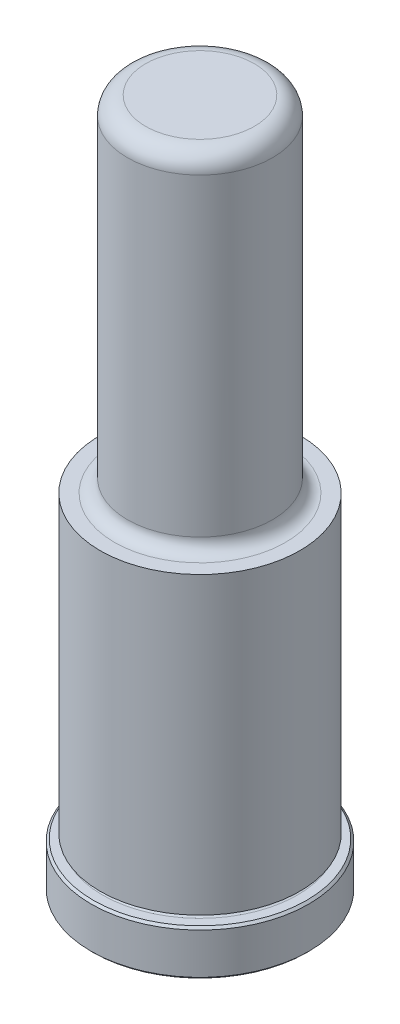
ISO-10303-21;
HEADER;
FILE_DESCRIPTION(('STEP AP214'),'2;1');
FILE_NAME('part.step','',(''),(''),'','','');
FILE_SCHEMA(('AUTOMOTIVE_DESIGN { 1 0 10303 214 1 1 1 1 }'));
ENDSEC;
DATA;
#1=APPLICATION_CONTEXT('core data for automotive mechanical design processes');
#2=APPLICATION_PROTOCOL_DEFINITION('international standard','automotive_design',2000,#1);
#3=PRODUCT_CONTEXT('',#1,'mechanical');
#4=PRODUCT('Part','Part','',(#3));
#5=PRODUCT_RELATED_PRODUCT_CATEGORY('part','',(#4));
#6=PRODUCT_DEFINITION_FORMATION('','',#4);
#7=PRODUCT_DEFINITION_CONTEXT('part definition',#1,'design');
#8=PRODUCT_DEFINITION('design','',#6,#7);
#9=PRODUCT_DEFINITION_SHAPE('','',#8);
#10=(LENGTH_UNIT() NAMED_UNIT(*) SI_UNIT(.MILLI.,.METRE.));
#11=(NAMED_UNIT(*) PLANE_ANGLE_UNIT() SI_UNIT($,.RADIAN.));
#12=(NAMED_UNIT(*) SI_UNIT($,.STERADIAN.) SOLID_ANGLE_UNIT());
#13=UNCERTAINTY_MEASURE_WITH_UNIT(LENGTH_MEASURE(1.E-05),#10,'distance_accuracy_value','');
#14=(GEOMETRIC_REPRESENTATION_CONTEXT(3) GLOBAL_UNCERTAINTY_ASSIGNED_CONTEXT((#13)) GLOBAL_UNIT_ASSIGNED_CONTEXT((#10,
#11,#12)) REPRESENTATION_CONTEXT('',''));
#15=CARTESIAN_POINT('',(0.,0.,0.));
#16=DIRECTION('',(0.,0.,1.));
#17=DIRECTION('',(1.,0.,0.));
#18=AXIS2_PLACEMENT_3D('',#15,#16,#17);
#19=CARTESIAN_POINT('',(0.,0.,0.));
#20=DIRECTION('',(0.,1.,0.));
#21=DIRECTION('',(0.,0.,1.));
#22=AXIS2_PLACEMENT_3D('',#19,#20,#21);
#23=PLANE('',#22);
#24=CARTESIAN_POINT('',(0.,0.,0.));
#25=DIRECTION('',(0.,1.,0.));
#26=DIRECTION('',(0.,0.,1.));
#27=AXIS2_PLACEMENT_3D('',#24,#25,#26);
#28=CIRCLE('',#27,18.669);
#29=CARTESIAN_POINT('',(0.,0.,18.669));
#30=VERTEX_POINT('',#29);
#31=EDGE_CURVE('E46',#30,#30,#28,.F.);
#32=ORIENTED_EDGE('',*,*,#31,.T.);
#33=EDGE_LOOP('',(#32));
#34=FACE_BOUND('',#33,.T.);
#35=ADVANCED_FACE('F31',(#34),#23,.F.);
#36=CARTESIAN_POINT('',(0.,0.,0.));
#37=DIRECTION('',(0.,1.,0.));
#38=DIRECTION('',(0.,0.,1.));
#39=AXIS2_PLACEMENT_3D('',#36,#37,#38);
#40=CYLINDRICAL_SURFACE('',#39,19.05);
#41=CARTESIAN_POINT('',(0.,0.380999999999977,0.));
#42=DIRECTION('',(0.,1.,0.));
#43=DIRECTION('',(0.,0.,1.));
#44=AXIS2_PLACEMENT_3D('',#41,#42,#43);
#45=CIRCLE('',#44,19.05);
#46=CARTESIAN_POINT('',(0.,0.380999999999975,19.05));
#47=VERTEX_POINT('',#46);
#48=EDGE_CURVE('E51',#47,#47,#45,.T.);
#49=ORIENTED_EDGE('',*,*,#48,.T.);
#50=EDGE_LOOP('',(#49));
#51=FACE_BOUND('',#50,.T.);
#52=CARTESIAN_POINT('',(0.,7.54380000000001,0.));
#53=DIRECTION('',(0.,-1.,0.));
#54=DIRECTION('',(0.,0.,-1.));
#55=AXIS2_PLACEMENT_3D('',#52,#53,#54);
#56=CIRCLE('',#55,19.05);
#57=CARTESIAN_POINT('',(0.,7.54380000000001,-19.05));
#58=VERTEX_POINT('',#57);
#59=EDGE_CURVE('E54',#58,#58,#56,.T.);
#60=ORIENTED_EDGE('',*,*,#59,.T.);
#61=EDGE_LOOP('',(#60));
#62=FACE_BOUND('',#61,.T.);
#63=ADVANCED_FACE('F110',(#51,#62),#40,.T.);
#64=CARTESIAN_POINT('',(0.,7.9248,-19.05));
#65=DIRECTION('',(0.,-1.,0.));
#66=DIRECTION('',(0.,0.,-1.));
#67=AXIS2_PLACEMENT_3D('',#64,#65,#66);
#68=PLANE('',#67);
#69=CARTESIAN_POINT('',(0.,7.9248,0.));
#70=DIRECTION('',(0.,-1.,0.));
#71=DIRECTION('',(0.,0.,-1.));
#72=AXIS2_PLACEMENT_3D('',#69,#70,#71);
#73=CIRCLE('',#72,18.669);
#74=CARTESIAN_POINT('',(0.,7.9248,-18.669));
#75=VERTEX_POINT('',#74);
#76=EDGE_CURVE('E42',#75,#75,#73,.F.);
#77=ORIENTED_EDGE('',*,*,#76,.T.);
#78=EDGE_LOOP('',(#77));
#79=FACE_BOUND('',#78,.T.);
#80=CARTESIAN_POINT('',(0.,7.9248,0.));
#81=DIRECTION('',(0.,1.,0.));
#82=DIRECTION('',(0.,0.,1.));
#83=AXIS2_PLACEMENT_3D('',#80,#81,#82);
#84=CIRCLE('',#83,17.0688);
#85=CARTESIAN_POINT('',(0.,7.92479999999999,17.0688));
#86=VERTEX_POINT('',#85);
#87=EDGE_CURVE('E57',#86,#86,#84,.T.);
#88=ORIENTED_EDGE('',*,*,#87,.F.);
#89=EDGE_LOOP('',(#88));
#90=FACE_BOUND('',#89,.T.);
#91=ADVANCED_FACE('F105',(#79,#90),#68,.F.);
#92=CARTESIAN_POINT('',(0.,8.3058,0.));
#93=DIRECTION('',(0.,1.,0.));
#94=DIRECTION('',(0.,0.,1.));
#95=AXIS2_PLACEMENT_3D('',#92,#93,#94);
#96=TOROIDAL_SURFACE('',#95,17.0688,0.381000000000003);
#97=CARTESIAN_POINT('',(0.,8.6868,0.));
#98=DIRECTION('',(0.,1.,0.));
#99=DIRECTION('',(0.,0.,1.));
#100=AXIS2_PLACEMENT_3D('',#97,#98,#99);
#101=CIRCLE('',#100,17.0688);
#102=CARTESIAN_POINT('',(0.,8.6868,17.0688));
#103=VERTEX_POINT('',#102);
#104=EDGE_CURVE('E60',#103,#103,#101,.T.);
#105=ORIENTED_EDGE('',*,*,#104,.F.);
#106=EDGE_LOOP('',(#105));
#107=FACE_BOUND('',#106,.T.);
#108=ORIENTED_EDGE('',*,*,#87,.T.);
#109=EDGE_LOOP('',(#108));
#110=FACE_BOUND('',#109,.T.);
#111=ADVANCED_FACE('F99',(#107,#110),#96,.F.);
#112=CARTESIAN_POINT('',(0.,8.6868,-17.0688));
#113=DIRECTION('',(0.,1.,0.));
#114=DIRECTION('',(0.,0.,1.));
#115=AXIS2_PLACEMENT_3D('',#112,#113,#114);
#116=PLANE('',#115);
#117=CARTESIAN_POINT('',(0.,8.6868,0.));
#118=DIRECTION('',(0.,1.,0.));
#119=DIRECTION('',(0.,0.,1.));
#120=AXIS2_PLACEMENT_3D('',#117,#118,#119);
#121=CIRCLE('',#120,17.4752);
#122=CARTESIAN_POINT('',(0.,8.6868,17.4752));
#123=VERTEX_POINT('',#122);
#124=EDGE_CURVE('E63',#123,#123,#121,.T.);
#125=ORIENTED_EDGE('',*,*,#124,.F.);
#126=EDGE_LOOP('',(#125));
#127=FACE_BOUND('',#126,.T.);
#128=ORIENTED_EDGE('',*,*,#104,.T.);
#129=EDGE_LOOP('',(#128));
#130=FACE_BOUND('',#129,.T.);
#131=ADVANCED_FACE('F93',(#127,#130),#116,.F.);
#132=CARTESIAN_POINT('',(0.,0.,0.));
#133=DIRECTION('',(0.,1.,0.));
#134=DIRECTION('',(0.,0.,1.));
#135=AXIS2_PLACEMENT_3D('',#132,#133,#134);
#136=CYLINDRICAL_SURFACE('',#135,17.4752);
#137=CARTESIAN_POINT('',(0.,60.325,0.));
#138=DIRECTION('',(0.,1.,0.));
#139=DIRECTION('',(0.,0.,1.));
#140=AXIS2_PLACEMENT_3D('',#137,#138,#139);
#141=CIRCLE('',#140,17.4752);
#142=CARTESIAN_POINT('',(0.,60.325,17.4752));
#143=VERTEX_POINT('',#142);
#144=EDGE_CURVE('E66',#143,#143,#141,.T.);
#145=ORIENTED_EDGE('',*,*,#144,.F.);
#146=EDGE_LOOP('',(#145));
#147=FACE_BOUND('',#146,.T.);
#148=ORIENTED_EDGE('',*,*,#124,.T.);
#149=EDGE_LOOP('',(#148));
#150=FACE_BOUND('',#149,.T.);
#151=ADVANCED_FACE('F87',(#147,#150),#136,.T.);
#152=CARTESIAN_POINT('',(0.,60.325,-17.4752));
#153=DIRECTION('',(0.,-1.,0.));
#154=DIRECTION('',(0.,0.,-1.));
#155=AXIS2_PLACEMENT_3D('',#152,#153,#154);
#156=PLANE('',#155);
#157=CARTESIAN_POINT('',(0.,60.325,0.));
#158=DIRECTION('',(0.,1.,0.));
#159=DIRECTION('',(0.,0.,1.));
#160=AXIS2_PLACEMENT_3D('',#157,#158,#159);
#161=CIRCLE('',#160,14.9733);
#162=CARTESIAN_POINT('',(0.,60.325,14.9733));
#163=VERTEX_POINT('',#162);
#164=EDGE_CURVE('E69',#163,#163,#161,.T.);
#165=ORIENTED_EDGE('',*,*,#164,.F.);
#166=EDGE_LOOP('',(#165));
#167=FACE_BOUND('',#166,.T.);
#168=ORIENTED_EDGE('',*,*,#144,.T.);
#169=EDGE_LOOP('',(#168));
#170=FACE_BOUND('',#169,.T.);
#171=ADVANCED_FACE('F81',(#167,#170),#156,.F.);
#172=CARTESIAN_POINT('',(0.,62.611,0.));
#173=DIRECTION('',(0.,1.,0.));
#174=DIRECTION('',(0.,0.,1.));
#175=AXIS2_PLACEMENT_3D('',#172,#173,#174);
#176=TOROIDAL_SURFACE('',#175,14.9733,2.286);
#177=CARTESIAN_POINT('',(0.,62.611,0.));
#178=DIRECTION('',(0.,1.,0.));
#179=DIRECTION('',(0.,0.,1.));
#180=AXIS2_PLACEMENT_3D('',#177,#178,#179);
#181=CIRCLE('',#180,12.6873);
#182=CARTESIAN_POINT('',(0.,62.611,12.6873));
#183=VERTEX_POINT('',#182);
#184=EDGE_CURVE('E72',#183,#183,#181,.T.);
#185=ORIENTED_EDGE('',*,*,#184,.F.);
#186=EDGE_LOOP('',(#185));
#187=FACE_BOUND('',#186,.T.);
#188=ORIENTED_EDGE('',*,*,#164,.T.);
#189=EDGE_LOOP('',(#188));
#190=FACE_BOUND('',#189,.T.);
#191=ADVANCED_FACE('F78',(#187,#190),#176,.F.);
#192=CARTESIAN_POINT('',(0.,0.,0.));
#193=DIRECTION('',(0.,1.,0.));
#194=DIRECTION('',(0.,0.,1.));
#195=AXIS2_PLACEMENT_3D('',#192,#193,#194);
#196=CYLINDRICAL_SURFACE('',#195,12.6873);
#197=CARTESIAN_POINT('',(0.,117.475,0.));
#198=DIRECTION('',(0.,-1.,0.));
#199=DIRECTION('',(0.,0.,-1.));
#200=AXIS2_PLACEMENT_3D('',#197,#198,#199);
#201=CIRCLE('',#200,12.6873);
#202=CARTESIAN_POINT('',(0.,117.475,-12.6873));
#203=VERTEX_POINT('',#202);
#204=EDGE_CURVE('E10',#203,#203,#201,.T.);
#205=ORIENTED_EDGE('',*,*,#204,.T.);
#206=EDGE_LOOP('',(#205));
#207=FACE_BOUND('',#206,.T.);
#208=ORIENTED_EDGE('',*,*,#184,.T.);
#209=EDGE_LOOP('',(#208));
#210=FACE_BOUND('',#209,.T.);
#211=ADVANCED_FACE('F76',(#207,#210),#196,.T.);
#212=CARTESIAN_POINT('',(0.,120.65,-12.6873));
#213=DIRECTION('',(0.,-1.,0.));
#214=DIRECTION('',(0.,0.,-1.));
#215=AXIS2_PLACEMENT_3D('',#212,#213,#214);
#216=PLANE('',#215);
#217=CARTESIAN_POINT('',(0.,120.65,0.));
#218=DIRECTION('',(0.,-1.,0.));
#219=DIRECTION('',(0.,0.,-1.));
#220=AXIS2_PLACEMENT_3D('',#217,#218,#219);
#221=CIRCLE('',#220,9.51230000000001);
#222=CARTESIAN_POINT('',(0.,120.65,-9.51229999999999));
#223=VERTEX_POINT('',#222);
#224=EDGE_CURVE('E38',#223,#223,#221,.F.);
#225=ORIENTED_EDGE('',*,*,#224,.T.);
#226=EDGE_LOOP('',(#225));
#227=FACE_BOUND('',#226,.T.);
#228=ADVANCED_FACE('F127',(#227),#216,.F.);
#229=CARTESIAN_POINT('',(0.,0.380999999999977,0.));
#230=DIRECTION('',(0.,1.,0.));
#231=DIRECTION('',(0.,0.,1.));
#232=AXIS2_PLACEMENT_3D('',#229,#230,#231);
#233=CONICAL_SURFACE('',#232,19.05,0.785398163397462);
#234=ORIENTED_EDGE('',*,*,#31,.F.);
#235=EDGE_LOOP('',(#234));
#236=FACE_BOUND('',#235,.T.);
#237=ORIENTED_EDGE('',*,*,#48,.F.);
#238=EDGE_LOOP('',(#237));
#239=FACE_BOUND('',#238,.T.);
#240=ADVANCED_FACE('F124',(#236,#239),#233,.T.);
#241=CARTESIAN_POINT('',(0.,7.9248,0.));
#242=DIRECTION('',(0.,-1.,0.));
#243=DIRECTION('',(0.,0.,-1.));
#244=AXIS2_PLACEMENT_3D('',#241,#242,#243);
#245=CONICAL_SURFACE('',#244,18.669,0.785398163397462);
#246=ORIENTED_EDGE('',*,*,#59,.F.);
#247=EDGE_LOOP('',(#246));
#248=FACE_BOUND('',#247,.T.);
#249=ORIENTED_EDGE('',*,*,#76,.F.);
#250=EDGE_LOOP('',(#249));
#251=FACE_BOUND('',#250,.T.);
#252=ADVANCED_FACE('F126',(#248,#251),#245,.T.);
#253=CARTESIAN_POINT('',(0.,117.475,0.));
#254=DIRECTION('',(0.,-1.,0.));
#255=DIRECTION('',(0.,0.,-1.));
#256=AXIS2_PLACEMENT_3D('',#253,#254,#255);
#257=TOROIDAL_SURFACE('',#256,9.51230000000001,3.175);
#258=ORIENTED_EDGE('',*,*,#204,.F.);
#259=EDGE_LOOP('',(#258));
#260=FACE_BOUND('',#259,.T.);
#261=ORIENTED_EDGE('',*,*,#224,.F.);
#262=EDGE_LOOP('',(#261));
#263=FACE_BOUND('',#262,.T.);
#264=ADVANCED_FACE('F33',(#260,#263),#257,.T.);
#265=CLOSED_SHELL('',(#35,#63,#91,#111,#131,#151,#171,#191,#211,#228,#240,#252,#264));
#266=MANIFOLD_SOLID_BREP('B2',#265);
#267=ADVANCED_BREP_SHAPE_REPRESENTATION('',(#18,#266),#14);
#268=SHAPE_DEFINITION_REPRESENTATION(#9,#267);
ENDSEC;
END-ISO-10303-21;
